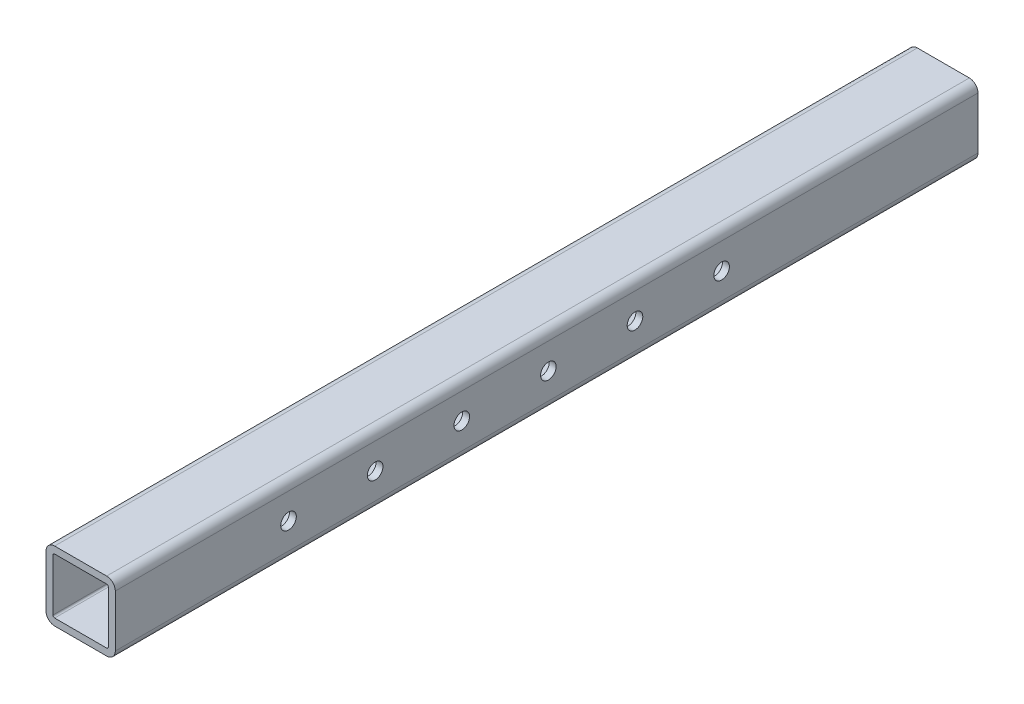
ISO-10303-21;
HEADER;
FILE_DESCRIPTION(('STEP AP214'),'2;1');
FILE_NAME('part.step','',(''),(''),'','','');
FILE_SCHEMA(('AUTOMOTIVE_DESIGN { 1 0 10303 214 1 1 1 1 }'));
ENDSEC;
DATA;
#1=APPLICATION_CONTEXT('core data for automotive mechanical design processes');
#2=APPLICATION_PROTOCOL_DEFINITION('international standard','automotive_design',2000,#1);
#3=PRODUCT_CONTEXT('',#1,'mechanical');
#4=PRODUCT('Part','Part','',(#3));
#5=PRODUCT_RELATED_PRODUCT_CATEGORY('part','',(#4));
#6=PRODUCT_DEFINITION_FORMATION('','',#4);
#7=PRODUCT_DEFINITION_CONTEXT('part definition',#1,'design');
#8=PRODUCT_DEFINITION('design','',#6,#7);
#9=PRODUCT_DEFINITION_SHAPE('','',#8);
#10=(LENGTH_UNIT() NAMED_UNIT(*) SI_UNIT(.MILLI.,.METRE.));
#11=(NAMED_UNIT(*) PLANE_ANGLE_UNIT() SI_UNIT($,.RADIAN.));
#12=(NAMED_UNIT(*) SI_UNIT($,.STERADIAN.) SOLID_ANGLE_UNIT());
#13=UNCERTAINTY_MEASURE_WITH_UNIT(LENGTH_MEASURE(1.E-05),#10,'distance_accuracy_value','');
#14=(GEOMETRIC_REPRESENTATION_CONTEXT(3) GLOBAL_UNCERTAINTY_ASSIGNED_CONTEXT((#13)) GLOBAL_UNIT_ASSIGNED_CONTEXT((#10,
#11,#12)) REPRESENTATION_CONTEXT('',''));
#15=CARTESIAN_POINT('',(0.,0.,0.));
#16=DIRECTION('',(0.,0.,1.));
#17=DIRECTION('',(1.,0.,0.));
#18=AXIS2_PLACEMENT_3D('',#15,#16,#17);
#19=CARTESIAN_POINT('',(35.,-5.,498.));
#20=DIRECTION('',(0.,0.,1.));
#21=DIRECTION('',(1.,0.,0.));
#22=AXIS2_PLACEMENT_3D('',#19,#20,#21);
#23=PLANE('',#22);
#24=CARTESIAN_POINT('',(35.,-5.,498.));
#25=DIRECTION('',(0.,0.,1.));
#26=DIRECTION('',(1.,0.,0.));
#27=AXIS2_PLACEMENT_3D('',#24,#25,#26);
#28=CIRCLE('',#27,5.);
#29=CARTESIAN_POINT('',(40.,-5.00000000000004,498.));
#30=VERTEX_POINT('',#29);
#31=CARTESIAN_POINT('',(35.,0.,498.));
#32=VERTEX_POINT('',#31);
#33=EDGE_CURVE('E229',#30,#32,#28,.T.);
#34=ORIENTED_EDGE('',*,*,#33,.T.);
#35=DIRECTION('',(-1.,0.,0.));
#36=VECTOR('',#35,1.);
#37=CARTESIAN_POINT('',(5.00000000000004,0.,498.));
#38=LINE('',#37,#36);
#39=CARTESIAN_POINT('',(5.00000000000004,0.,498.));
#40=VERTEX_POINT('',#39);
#41=EDGE_CURVE('E232',#32,#40,#38,.T.);
#42=ORIENTED_EDGE('',*,*,#41,.T.);
#43=CARTESIAN_POINT('',(5.,-5.,498.));
#44=DIRECTION('',(0.,0.,1.));
#45=DIRECTION('',(1.,0.,0.));
#46=AXIS2_PLACEMENT_3D('',#43,#44,#45);
#47=CIRCLE('',#46,5.);
#48=CARTESIAN_POINT('',(0.,-5.00000000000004,498.));
#49=VERTEX_POINT('',#48);
#50=EDGE_CURVE('E234',#40,#49,#47,.T.);
#51=ORIENTED_EDGE('',*,*,#50,.T.);
#52=DIRECTION('',(0.,-1.,0.));
#53=VECTOR('',#52,1.);
#54=CARTESIAN_POINT('',(0.,-5.00000000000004,498.));
#55=LINE('',#54,#53);
#56=CARTESIAN_POINT('',(0.,-35.,498.));
#57=VERTEX_POINT('',#56);
#58=EDGE_CURVE('E236',#49,#57,#55,.T.);
#59=ORIENTED_EDGE('',*,*,#58,.T.);
#60=CARTESIAN_POINT('',(5.,-35.,498.));
#61=DIRECTION('',(0.,0.,1.));
#62=DIRECTION('',(1.,0.,0.));
#63=AXIS2_PLACEMENT_3D('',#60,#61,#62);
#64=CIRCLE('',#63,5.);
#65=CARTESIAN_POINT('',(5.00000000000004,-40.,498.));
#66=VERTEX_POINT('',#65);
#67=EDGE_CURVE('E238',#57,#66,#64,.T.);
#68=ORIENTED_EDGE('',*,*,#67,.T.);
#69=DIRECTION('',(1.,0.,0.));
#70=VECTOR('',#69,1.);
#71=CARTESIAN_POINT('',(5.00000000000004,-40.,498.));
#72=LINE('',#71,#70);
#73=CARTESIAN_POINT('',(35.,-40.,498.));
#74=VERTEX_POINT('',#73);
#75=EDGE_CURVE('E240',#66,#74,#72,.T.);
#76=ORIENTED_EDGE('',*,*,#75,.T.);
#77=CARTESIAN_POINT('',(35.,-35.,498.));
#78=DIRECTION('',(0.,0.,1.));
#79=DIRECTION('',(1.,0.,0.));
#80=AXIS2_PLACEMENT_3D('',#77,#78,#79);
#81=CIRCLE('',#80,5.);
#82=CARTESIAN_POINT('',(40.,-35.,498.));
#83=VERTEX_POINT('',#82);
#84=EDGE_CURVE('E242',#74,#83,#81,.T.);
#85=ORIENTED_EDGE('',*,*,#84,.T.);
#86=DIRECTION('',(0.,1.,0.));
#87=VECTOR('',#86,1.);
#88=CARTESIAN_POINT('',(40.,-5.00000000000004,498.));
#89=LINE('',#88,#87);
#90=EDGE_CURVE('E244',#83,#30,#89,.T.);
#91=ORIENTED_EDGE('',*,*,#90,.T.);
#92=EDGE_LOOP('',(#34,#42,#51,#59,#68,#76,#85,#91));
#93=FACE_BOUND('',#92,.T.);
#94=DIRECTION('',(0.,-1.,0.));
#95=VECTOR('',#94,1.);
#96=CARTESIAN_POINT('',(4.,-5.00000000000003,498.));
#97=LINE('',#96,#95);
#98=CARTESIAN_POINT('',(4.,-5.00000000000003,498.));
#99=VERTEX_POINT('',#98);
#100=CARTESIAN_POINT('',(4.,-35.,498.));
#101=VERTEX_POINT('',#100);
#102=EDGE_CURVE('E187',#99,#101,#97,.T.);
#103=ORIENTED_EDGE('',*,*,#102,.F.);
#104=CARTESIAN_POINT('',(5.,-5.,498.));
#105=DIRECTION('',(0.,0.,1.));
#106=DIRECTION('',(1.,0.,0.));
#107=AXIS2_PLACEMENT_3D('',#104,#105,#106);
#108=CIRCLE('',#107,1.);
#109=CARTESIAN_POINT('',(5.00000000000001,-4.,498.));
#110=VERTEX_POINT('',#109);
#111=EDGE_CURVE('E159',#110,#99,#108,.T.);
#112=ORIENTED_EDGE('',*,*,#111,.F.);
#113=DIRECTION('',(-1.,0.,0.));
#114=VECTOR('',#113,1.);
#115=CARTESIAN_POINT('',(5.00000000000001,-4.,498.));
#116=LINE('',#115,#114);
#117=CARTESIAN_POINT('',(35.,-4.,498.));
#118=VERTEX_POINT('',#117);
#119=EDGE_CURVE('E199',#118,#110,#116,.T.);
#120=ORIENTED_EDGE('',*,*,#119,.F.);
#121=CARTESIAN_POINT('',(35.,-5.,498.));
#122=DIRECTION('',(0.,0.,1.));
#123=DIRECTION('',(1.,0.,0.));
#124=AXIS2_PLACEMENT_3D('',#121,#122,#123);
#125=CIRCLE('',#124,1.);
#126=CARTESIAN_POINT('',(36.,-5.00000000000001,498.));
#127=VERTEX_POINT('',#126);
#128=EDGE_CURVE('E197',#127,#118,#125,.T.);
#129=ORIENTED_EDGE('',*,*,#128,.F.);
#130=DIRECTION('',(0.,1.,0.));
#131=VECTOR('',#130,1.);
#132=CARTESIAN_POINT('',(36.,-5.00000000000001,498.));
#133=LINE('',#132,#131);
#134=CARTESIAN_POINT('',(36.,-35.,498.));
#135=VERTEX_POINT('',#134);
#136=EDGE_CURVE('E195',#135,#127,#133,.T.);
#137=ORIENTED_EDGE('',*,*,#136,.F.);
#138=CARTESIAN_POINT('',(35.,-35.,498.));
#139=DIRECTION('',(0.,0.,1.));
#140=DIRECTION('',(1.,0.,0.));
#141=AXIS2_PLACEMENT_3D('',#138,#139,#140);
#142=CIRCLE('',#141,1.);
#143=CARTESIAN_POINT('',(35.,-36.,498.));
#144=VERTEX_POINT('',#143);
#145=EDGE_CURVE('E193',#144,#135,#142,.T.);
#146=ORIENTED_EDGE('',*,*,#145,.F.);
#147=DIRECTION('',(1.,0.,0.));
#148=VECTOR('',#147,1.);
#149=CARTESIAN_POINT('',(5.00000000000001,-36.,498.));
#150=LINE('',#149,#148);
#151=CARTESIAN_POINT('',(5.00000000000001,-36.,498.));
#152=VERTEX_POINT('',#151);
#153=EDGE_CURVE('E191',#152,#144,#150,.T.);
#154=ORIENTED_EDGE('',*,*,#153,.F.);
#155=CARTESIAN_POINT('',(5.,-35.,498.));
#156=DIRECTION('',(0.,0.,1.));
#157=DIRECTION('',(1.,0.,0.));
#158=AXIS2_PLACEMENT_3D('',#155,#156,#157);
#159=CIRCLE('',#158,1.);
#160=EDGE_CURVE('E189',#101,#152,#159,.T.);
#161=ORIENTED_EDGE('',*,*,#160,.F.);
#162=EDGE_LOOP('',(#103,#112,#120,#129,#137,#146,#154,#161));
#163=FACE_BOUND('',#162,.T.);
#164=ADVANCED_FACE('F29',(#93,#163),#23,.T.);
#165=CARTESIAN_POINT('',(35.,-5.,0.));
#166=DIRECTION('',(0.,0.,1.));
#167=DIRECTION('',(1.,0.,0.));
#168=AXIS2_PLACEMENT_3D('',#165,#166,#167);
#169=PLANE('',#168);
#170=CARTESIAN_POINT('',(35.,-5.,0.));
#171=DIRECTION('',(0.,0.,1.));
#172=DIRECTION('',(1.,0.,0.));
#173=AXIS2_PLACEMENT_3D('',#170,#171,#172);
#174=CIRCLE('',#173,5.);
#175=CARTESIAN_POINT('',(40.,-5.00000000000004,0.));
#176=VERTEX_POINT('',#175);
#177=CARTESIAN_POINT('',(35.,0.,0.));
#178=VERTEX_POINT('',#177);
#179=EDGE_CURVE('E160',#176,#178,#174,.T.);
#180=ORIENTED_EDGE('',*,*,#179,.F.);
#181=DIRECTION('',(0.,1.,0.));
#182=VECTOR('',#181,1.);
#183=CARTESIAN_POINT('',(40.,-5.00000000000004,0.));
#184=LINE('',#183,#182);
#185=CARTESIAN_POINT('',(40.,-35.,0.));
#186=VERTEX_POINT('',#185);
#187=EDGE_CURVE('E227',#186,#176,#184,.T.);
#188=ORIENTED_EDGE('',*,*,#187,.F.);
#189=CARTESIAN_POINT('',(35.,-35.,0.));
#190=DIRECTION('',(0.,0.,1.));
#191=DIRECTION('',(1.,0.,0.));
#192=AXIS2_PLACEMENT_3D('',#189,#190,#191);
#193=CIRCLE('',#192,5.);
#194=CARTESIAN_POINT('',(35.,-40.,0.));
#195=VERTEX_POINT('',#194);
#196=EDGE_CURVE('E225',#195,#186,#193,.T.);
#197=ORIENTED_EDGE('',*,*,#196,.F.);
#198=DIRECTION('',(1.,0.,0.));
#199=VECTOR('',#198,1.);
#200=CARTESIAN_POINT('',(5.00000000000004,-40.,0.));
#201=LINE('',#200,#199);
#202=CARTESIAN_POINT('',(5.00000000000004,-40.,0.));
#203=VERTEX_POINT('',#202);
#204=EDGE_CURVE('E223',#203,#195,#201,.T.);
#205=ORIENTED_EDGE('',*,*,#204,.F.);
#206=CARTESIAN_POINT('',(5.,-35.,0.));
#207=DIRECTION('',(0.,0.,1.));
#208=DIRECTION('',(1.,0.,0.));
#209=AXIS2_PLACEMENT_3D('',#206,#207,#208);
#210=CIRCLE('',#209,5.);
#211=CARTESIAN_POINT('',(0.,-35.,0.));
#212=VERTEX_POINT('',#211);
#213=EDGE_CURVE('E221',#212,#203,#210,.T.);
#214=ORIENTED_EDGE('',*,*,#213,.F.);
#215=DIRECTION('',(0.,-1.,0.));
#216=VECTOR('',#215,1.);
#217=CARTESIAN_POINT('',(0.,-5.00000000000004,0.));
#218=LINE('',#217,#216);
#219=CARTESIAN_POINT('',(0.,-5.00000000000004,0.));
#220=VERTEX_POINT('',#219);
#221=EDGE_CURVE('E219',#220,#212,#218,.T.);
#222=ORIENTED_EDGE('',*,*,#221,.F.);
#223=CARTESIAN_POINT('',(5.,-5.,0.));
#224=DIRECTION('',(0.,0.,1.));
#225=DIRECTION('',(1.,0.,0.));
#226=AXIS2_PLACEMENT_3D('',#223,#224,#225);
#227=CIRCLE('',#226,5.);
#228=CARTESIAN_POINT('',(5.00000000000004,0.,0.));
#229=VERTEX_POINT('',#228);
#230=EDGE_CURVE('E217',#229,#220,#227,.T.);
#231=ORIENTED_EDGE('',*,*,#230,.F.);
#232=DIRECTION('',(-1.,0.,0.));
#233=VECTOR('',#232,1.);
#234=CARTESIAN_POINT('',(5.00000000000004,0.,0.));
#235=LINE('',#234,#233);
#236=EDGE_CURVE('E215',#178,#229,#235,.T.);
#237=ORIENTED_EDGE('',*,*,#236,.F.);
#238=EDGE_LOOP('',(#180,#188,#197,#205,#214,#222,#231,#237));
#239=FACE_BOUND('',#238,.T.);
#240=CARTESIAN_POINT('',(5.,-5.,0.));
#241=DIRECTION('',(0.,0.,1.));
#242=DIRECTION('',(1.,0.,0.));
#243=AXIS2_PLACEMENT_3D('',#240,#241,#242);
#244=CIRCLE('',#243,1.);
#245=CARTESIAN_POINT('',(5.00000000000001,-4.,0.));
#246=VERTEX_POINT('',#245);
#247=CARTESIAN_POINT('',(4.,-5.00000000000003,0.));
#248=VERTEX_POINT('',#247);
#249=EDGE_CURVE('E54',#246,#248,#244,.T.);
#250=ORIENTED_EDGE('',*,*,#249,.T.);
#251=DIRECTION('',(0.,-1.,0.));
#252=VECTOR('',#251,1.);
#253=CARTESIAN_POINT('',(4.,-5.00000000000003,0.));
#254=LINE('',#253,#252);
#255=CARTESIAN_POINT('',(4.,-35.,0.));
#256=VERTEX_POINT('',#255);
#257=EDGE_CURVE('E146',#248,#256,#254,.T.);
#258=ORIENTED_EDGE('',*,*,#257,.T.);
#259=CARTESIAN_POINT('',(5.,-35.,0.));
#260=DIRECTION('',(0.,0.,1.));
#261=DIRECTION('',(1.,0.,0.));
#262=AXIS2_PLACEMENT_3D('',#259,#260,#261);
#263=CIRCLE('',#262,1.);
#264=CARTESIAN_POINT('',(5.00000000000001,-36.,0.));
#265=VERTEX_POINT('',#264);
#266=EDGE_CURVE('E155',#256,#265,#263,.T.);
#267=ORIENTED_EDGE('',*,*,#266,.T.);
#268=DIRECTION('',(1.,0.,0.));
#269=VECTOR('',#268,1.);
#270=CARTESIAN_POINT('',(5.00000000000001,-36.,0.));
#271=LINE('',#270,#269);
#272=CARTESIAN_POINT('',(35.,-36.,0.));
#273=VERTEX_POINT('',#272);
#274=EDGE_CURVE('E174',#265,#273,#271,.T.);
#275=ORIENTED_EDGE('',*,*,#274,.T.);
#276=CARTESIAN_POINT('',(35.,-35.,0.));
#277=DIRECTION('',(0.,0.,1.));
#278=DIRECTION('',(1.,0.,0.));
#279=AXIS2_PLACEMENT_3D('',#276,#277,#278);
#280=CIRCLE('',#279,1.);
#281=CARTESIAN_POINT('',(36.,-35.,0.));
#282=VERTEX_POINT('',#281);
#283=EDGE_CURVE('E177',#273,#282,#280,.T.);
#284=ORIENTED_EDGE('',*,*,#283,.T.);
#285=DIRECTION('',(0.,1.,0.));
#286=VECTOR('',#285,1.);
#287=CARTESIAN_POINT('',(36.,-5.00000000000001,0.));
#288=LINE('',#287,#286);
#289=CARTESIAN_POINT('',(36.,-5.00000000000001,0.));
#290=VERTEX_POINT('',#289);
#291=EDGE_CURVE('E180',#282,#290,#288,.T.);
#292=ORIENTED_EDGE('',*,*,#291,.T.);
#293=CARTESIAN_POINT('',(35.,-5.,0.));
#294=DIRECTION('',(0.,0.,1.));
#295=DIRECTION('',(1.,0.,0.));
#296=AXIS2_PLACEMENT_3D('',#293,#294,#295);
#297=CIRCLE('',#296,1.);
#298=CARTESIAN_POINT('',(35.,-4.,0.));
#299=VERTEX_POINT('',#298);
#300=EDGE_CURVE('E183',#290,#299,#297,.T.);
#301=ORIENTED_EDGE('',*,*,#300,.T.);
#302=DIRECTION('',(-1.,0.,0.));
#303=VECTOR('',#302,1.);
#304=CARTESIAN_POINT('',(5.00000000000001,-4.,0.));
#305=LINE('',#304,#303);
#306=EDGE_CURVE('E165',#299,#246,#305,.T.);
#307=ORIENTED_EDGE('',*,*,#306,.T.);
#308=EDGE_LOOP('',(#250,#258,#267,#275,#284,#292,#301,#307));
#309=FACE_BOUND('',#308,.T.);
#310=ADVANCED_FACE('F163',(#239,#309),#169,.F.);
#311=CARTESIAN_POINT('',(35.,-5.,498.));
#312=DIRECTION('',(0.,0.,-1.));
#313=DIRECTION('',(-1.,0.,0.));
#314=AXIS2_PLACEMENT_3D('',#311,#312,#313);
#315=CYLINDRICAL_SURFACE('',#314,5.);
#316=ORIENTED_EDGE('',*,*,#179,.T.);
#317=DIRECTION('',(0.,0.,-1.));
#318=VECTOR('',#317,1.);
#319=CARTESIAN_POINT('',(35.,0.,498.));
#320=LINE('',#319,#318);
#321=EDGE_CURVE('E11',#32,#178,#320,.T.);
#322=ORIENTED_EDGE('',*,*,#321,.F.);
#323=ORIENTED_EDGE('',*,*,#33,.F.);
#324=DIRECTION('',(0.,0.,-1.));
#325=VECTOR('',#324,1.);
#326=CARTESIAN_POINT('',(40.,-5.00000000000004,498.));
#327=LINE('',#326,#325);
#328=EDGE_CURVE('E246',#30,#176,#327,.T.);
#329=ORIENTED_EDGE('',*,*,#328,.T.);
#330=EDGE_LOOP('',(#316,#322,#323,#329));
#331=FACE_BOUND('',#330,.T.);
#332=ADVANCED_FACE('F31',(#331),#315,.T.);
#333=CARTESIAN_POINT('',(5.00000000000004,0.,498.));
#334=DIRECTION('',(0.,-1.,0.));
#335=DIRECTION('',(0.,0.,-1.));
#336=AXIS2_PLACEMENT_3D('',#333,#334,#335);
#337=PLANE('',#336);
#338=ORIENTED_EDGE('',*,*,#236,.T.);
#339=DIRECTION('',(0.,0.,-1.));
#340=VECTOR('',#339,1.);
#341=CARTESIAN_POINT('',(5.00000000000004,0.,498.));
#342=LINE('',#341,#340);
#343=EDGE_CURVE('E38',#40,#229,#342,.T.);
#344=ORIENTED_EDGE('',*,*,#343,.F.);
#345=ORIENTED_EDGE('',*,*,#41,.F.);
#346=ORIENTED_EDGE('',*,*,#321,.T.);
#347=EDGE_LOOP('',(#338,#344,#345,#346));
#348=FACE_BOUND('',#347,.T.);
#349=ADVANCED_FACE('F377',(#348),#337,.F.);
#350=CARTESIAN_POINT('',(5.,-5.,498.));
#351=DIRECTION('',(0.,0.,-1.));
#352=DIRECTION('',(-1.,0.,0.));
#353=AXIS2_PLACEMENT_3D('',#350,#351,#352);
#354=CYLINDRICAL_SURFACE('',#353,5.);
#355=ORIENTED_EDGE('',*,*,#230,.T.);
#356=DIRECTION('',(0.,0.,-1.));
#357=VECTOR('',#356,1.);
#358=CARTESIAN_POINT('',(0.,-5.00000000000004,498.));
#359=LINE('',#358,#357);
#360=EDGE_CURVE('E261',#49,#220,#359,.T.);
#361=ORIENTED_EDGE('',*,*,#360,.F.);
#362=ORIENTED_EDGE('',*,*,#50,.F.);
#363=ORIENTED_EDGE('',*,*,#343,.T.);
#364=EDGE_LOOP('',(#355,#361,#362,#363));
#365=FACE_BOUND('',#364,.T.);
#366=ADVANCED_FACE('F374',(#365),#354,.T.);
#367=CARTESIAN_POINT('',(0.,-5.00000000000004,498.));
#368=DIRECTION('',(1.,0.,0.));
#369=DIRECTION('',(0.,1.,0.));
#370=AXIS2_PLACEMENT_3D('',#367,#368,#369);
#371=PLANE('',#370);
#372=CARTESIAN_POINT('',(0.,-20.,148.));
#373=DIRECTION('',(-1.,0.,0.));
#374=DIRECTION('',(0.,-1.,0.));
#375=AXIS2_PLACEMENT_3D('',#372,#373,#374);
#376=CIRCLE('',#375,4.49999999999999);
#377=CARTESIAN_POINT('',(0.,-24.5,148.));
#378=VERTEX_POINT('',#377);
#379=EDGE_CURVE('E628',#378,#378,#376,.T.);
#380=ORIENTED_EDGE('',*,*,#379,.F.);
#381=EDGE_LOOP('',(#380));
#382=FACE_BOUND('',#381,.T.);
#383=CARTESIAN_POINT('',(0.,-20.,198.));
#384=DIRECTION('',(-1.,0.,0.));
#385=DIRECTION('',(0.,-1.,0.));
#386=AXIS2_PLACEMENT_3D('',#383,#384,#385);
#387=CIRCLE('',#386,4.49999999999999);
#388=CARTESIAN_POINT('',(0.,-24.5,198.));
#389=VERTEX_POINT('',#388);
#390=EDGE_CURVE('E293',#389,#389,#387,.T.);
#391=ORIENTED_EDGE('',*,*,#390,.F.);
#392=EDGE_LOOP('',(#391));
#393=FACE_BOUND('',#392,.T.);
#394=CARTESIAN_POINT('',(0.,-20.,248.));
#395=DIRECTION('',(-1.,0.,0.));
#396=DIRECTION('',(0.,-1.,0.));
#397=AXIS2_PLACEMENT_3D('',#394,#395,#396);
#398=CIRCLE('',#397,4.50000000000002);
#399=CARTESIAN_POINT('',(0.,-24.5,248.));
#400=VERTEX_POINT('',#399);
#401=EDGE_CURVE('E290',#400,#400,#398,.T.);
#402=ORIENTED_EDGE('',*,*,#401,.F.);
#403=EDGE_LOOP('',(#402));
#404=FACE_BOUND('',#403,.T.);
#405=CARTESIAN_POINT('',(0.,-20.,298.));
#406=DIRECTION('',(-1.,0.,0.));
#407=DIRECTION('',(0.,-1.,0.));
#408=AXIS2_PLACEMENT_3D('',#405,#406,#407);
#409=CIRCLE('',#408,4.50000000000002);
#410=CARTESIAN_POINT('',(0.,-24.5,298.));
#411=VERTEX_POINT('',#410);
#412=EDGE_CURVE('E308',#411,#411,#409,.T.);
#413=ORIENTED_EDGE('',*,*,#412,.F.);
#414=EDGE_LOOP('',(#413));
#415=FACE_BOUND('',#414,.T.);
#416=CARTESIAN_POINT('',(0.,-20.,348.));
#417=DIRECTION('',(-1.,0.,0.));
#418=DIRECTION('',(0.,-1.,0.));
#419=AXIS2_PLACEMENT_3D('',#416,#417,#418);
#420=CIRCLE('',#419,4.50000000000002);
#421=CARTESIAN_POINT('',(0.,-24.5,348.));
#422=VERTEX_POINT('',#421);
#423=EDGE_CURVE('E315',#422,#422,#420,.T.);
#424=ORIENTED_EDGE('',*,*,#423,.F.);
#425=EDGE_LOOP('',(#424));
#426=FACE_BOUND('',#425,.T.);
#427=CARTESIAN_POINT('',(0.,-20.,398.));
#428=DIRECTION('',(-1.,0.,0.));
#429=DIRECTION('',(0.,-1.,0.));
#430=AXIS2_PLACEMENT_3D('',#427,#428,#429);
#431=CIRCLE('',#430,4.50000000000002);
#432=CARTESIAN_POINT('',(0.,-24.5,398.));
#433=VERTEX_POINT('',#432);
#434=EDGE_CURVE('E322',#433,#433,#431,.T.);
#435=ORIENTED_EDGE('',*,*,#434,.F.);
#436=EDGE_LOOP('',(#435));
#437=FACE_BOUND('',#436,.T.);
#438=ORIENTED_EDGE('',*,*,#221,.T.);
#439=DIRECTION('',(0.,0.,-1.));
#440=VECTOR('',#439,1.);
#441=CARTESIAN_POINT('',(0.,-35.,498.));
#442=LINE('',#441,#440);
#443=EDGE_CURVE('E258',#57,#212,#442,.T.);
#444=ORIENTED_EDGE('',*,*,#443,.F.);
#445=ORIENTED_EDGE('',*,*,#58,.F.);
#446=ORIENTED_EDGE('',*,*,#360,.T.);
#447=EDGE_LOOP('',(#438,#444,#445,#446));
#448=FACE_BOUND('',#447,.T.);
#449=ADVANCED_FACE('F370',(#382,#393,#404,#415,#426,#437,#448),#371,.F.);
#450=CARTESIAN_POINT('',(5.,-35.,498.));
#451=DIRECTION('',(0.,0.,-1.));
#452=DIRECTION('',(-1.,0.,0.));
#453=AXIS2_PLACEMENT_3D('',#450,#451,#452);
#454=CYLINDRICAL_SURFACE('',#453,5.);
#455=ORIENTED_EDGE('',*,*,#213,.T.);
#456=DIRECTION('',(0.,0.,-1.));
#457=VECTOR('',#456,1.);
#458=CARTESIAN_POINT('',(5.00000000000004,-40.,498.));
#459=LINE('',#458,#457);
#460=EDGE_CURVE('E255',#66,#203,#459,.T.);
#461=ORIENTED_EDGE('',*,*,#460,.F.);
#462=ORIENTED_EDGE('',*,*,#67,.F.);
#463=ORIENTED_EDGE('',*,*,#443,.T.);
#464=EDGE_LOOP('',(#455,#461,#462,#463));
#465=FACE_BOUND('',#464,.T.);
#466=ADVANCED_FACE('F366',(#465),#454,.T.);
#467=CARTESIAN_POINT('',(5.00000000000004,-40.,498.));
#468=DIRECTION('',(0.,1.,0.));
#469=DIRECTION('',(0.,0.,1.));
#470=AXIS2_PLACEMENT_3D('',#467,#468,#469);
#471=PLANE('',#470);
#472=ORIENTED_EDGE('',*,*,#204,.T.);
#473=DIRECTION('',(0.,0.,-1.));
#474=VECTOR('',#473,1.);
#475=CARTESIAN_POINT('',(35.,-40.,498.));
#476=LINE('',#475,#474);
#477=EDGE_CURVE('E252',#74,#195,#476,.T.);
#478=ORIENTED_EDGE('',*,*,#477,.F.);
#479=ORIENTED_EDGE('',*,*,#75,.F.);
#480=ORIENTED_EDGE('',*,*,#460,.T.);
#481=EDGE_LOOP('',(#472,#478,#479,#480));
#482=FACE_BOUND('',#481,.T.);
#483=ADVANCED_FACE('F362',(#482),#471,.F.);
#484=CARTESIAN_POINT('',(35.,-35.,498.));
#485=DIRECTION('',(0.,0.,-1.));
#486=DIRECTION('',(-1.,0.,0.));
#487=AXIS2_PLACEMENT_3D('',#484,#485,#486);
#488=CYLINDRICAL_SURFACE('',#487,5.);
#489=ORIENTED_EDGE('',*,*,#196,.T.);
#490=DIRECTION('',(0.,0.,-1.));
#491=VECTOR('',#490,1.);
#492=CARTESIAN_POINT('',(40.,-35.,498.));
#493=LINE('',#492,#491);
#494=EDGE_CURVE('E249',#83,#186,#493,.T.);
#495=ORIENTED_EDGE('',*,*,#494,.F.);
#496=ORIENTED_EDGE('',*,*,#84,.F.);
#497=ORIENTED_EDGE('',*,*,#477,.T.);
#498=EDGE_LOOP('',(#489,#495,#496,#497));
#499=FACE_BOUND('',#498,.T.);
#500=ADVANCED_FACE('F358',(#499),#488,.T.);
#501=CARTESIAN_POINT('',(40.,-5.00000000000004,498.));
#502=DIRECTION('',(-1.,0.,0.));
#503=DIRECTION('',(0.,-1.,0.));
#504=AXIS2_PLACEMENT_3D('',#501,#502,#503);
#505=PLANE('',#504);
#506=CARTESIAN_POINT('',(40.,-20.,148.));
#507=DIRECTION('',(-1.,0.,0.));
#508=DIRECTION('',(0.,-1.,0.));
#509=AXIS2_PLACEMENT_3D('',#506,#507,#508);
#510=CIRCLE('',#509,4.49999999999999);
#511=CARTESIAN_POINT('',(40.,-24.5,148.));
#512=VERTEX_POINT('',#511);
#513=EDGE_CURVE('E629',#512,#512,#510,.T.);
#514=ORIENTED_EDGE('',*,*,#513,.T.);
#515=EDGE_LOOP('',(#514));
#516=FACE_BOUND('',#515,.T.);
#517=CARTESIAN_POINT('',(40.,-20.,198.));
#518=DIRECTION('',(-1.,0.,0.));
#519=DIRECTION('',(0.,-1.,0.));
#520=AXIS2_PLACEMENT_3D('',#517,#518,#519);
#521=CIRCLE('',#520,4.49999999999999);
#522=CARTESIAN_POINT('',(40.,-24.5,198.));
#523=VERTEX_POINT('',#522);
#524=EDGE_CURVE('E286',#523,#523,#521,.T.);
#525=ORIENTED_EDGE('',*,*,#524,.T.);
#526=EDGE_LOOP('',(#525));
#527=FACE_BOUND('',#526,.T.);
#528=CARTESIAN_POINT('',(40.,-20.,248.));
#529=DIRECTION('',(-1.,0.,0.));
#530=DIRECTION('',(0.,-1.,0.));
#531=AXIS2_PLACEMENT_3D('',#528,#529,#530);
#532=CIRCLE('',#531,4.50000000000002);
#533=CARTESIAN_POINT('',(40.,-24.5,248.));
#534=VERTEX_POINT('',#533);
#535=EDGE_CURVE('E282',#534,#534,#532,.T.);
#536=ORIENTED_EDGE('',*,*,#535,.T.);
#537=EDGE_LOOP('',(#536));
#538=FACE_BOUND('',#537,.T.);
#539=CARTESIAN_POINT('',(40.,-20.,298.));
#540=DIRECTION('',(-1.,0.,0.));
#541=DIRECTION('',(0.,-1.,0.));
#542=AXIS2_PLACEMENT_3D('',#539,#540,#541);
#543=CIRCLE('',#542,4.50000000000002);
#544=CARTESIAN_POINT('',(40.,-24.5,298.));
#545=VERTEX_POINT('',#544);
#546=EDGE_CURVE('E278',#545,#545,#543,.T.);
#547=ORIENTED_EDGE('',*,*,#546,.T.);
#548=EDGE_LOOP('',(#547));
#549=FACE_BOUND('',#548,.T.);
#550=CARTESIAN_POINT('',(40.,-20.,348.));
#551=DIRECTION('',(-1.,0.,0.));
#552=DIRECTION('',(0.,-1.,0.));
#553=AXIS2_PLACEMENT_3D('',#550,#551,#552);
#554=CIRCLE('',#553,4.50000000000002);
#555=CARTESIAN_POINT('',(40.,-24.5,348.));
#556=VERTEX_POINT('',#555);
#557=EDGE_CURVE('E273',#556,#556,#554,.T.);
#558=ORIENTED_EDGE('',*,*,#557,.T.);
#559=EDGE_LOOP('',(#558));
#560=FACE_BOUND('',#559,.T.);
#561=CARTESIAN_POINT('',(40.,-20.,398.));
#562=DIRECTION('',(-1.,0.,0.));
#563=DIRECTION('',(0.,-1.,0.));
#564=AXIS2_PLACEMENT_3D('',#561,#562,#563);
#565=CIRCLE('',#564,4.50000000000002);
#566=CARTESIAN_POINT('',(40.,-24.5,398.));
#567=VERTEX_POINT('',#566);
#568=EDGE_CURVE('E268',#567,#567,#565,.T.);
#569=ORIENTED_EDGE('',*,*,#568,.T.);
#570=EDGE_LOOP('',(#569));
#571=FACE_BOUND('',#570,.T.);
#572=ORIENTED_EDGE('',*,*,#187,.T.);
#573=ORIENTED_EDGE('',*,*,#328,.F.);
#574=ORIENTED_EDGE('',*,*,#90,.F.);
#575=ORIENTED_EDGE('',*,*,#494,.T.);
#576=EDGE_LOOP('',(#572,#573,#574,#575));
#577=FACE_BOUND('',#576,.T.);
#578=ADVANCED_FACE('F327',(#516,#527,#538,#549,#560,#571,#577),#505,.F.);
#579=CARTESIAN_POINT('',(5.,-5.,498.));
#580=DIRECTION('',(0.,0.,-1.));
#581=DIRECTION('',(-1.,0.,0.));
#582=AXIS2_PLACEMENT_3D('',#579,#580,#581);
#583=CYLINDRICAL_SURFACE('',#582,1.);
#584=ORIENTED_EDGE('',*,*,#249,.F.);
#585=DIRECTION('',(0.,0.,-1.));
#586=VECTOR('',#585,1.);
#587=CARTESIAN_POINT('',(5.00000000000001,-4.,498.));
#588=LINE('',#587,#586);
#589=EDGE_CURVE('E201',#110,#246,#588,.T.);
#590=ORIENTED_EDGE('',*,*,#589,.F.);
#591=ORIENTED_EDGE('',*,*,#111,.T.);
#592=DIRECTION('',(0.,0.,-1.));
#593=VECTOR('',#592,1.);
#594=CARTESIAN_POINT('',(4.,-5.00000000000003,498.));
#595=LINE('',#594,#593);
#596=EDGE_CURVE('E148',#99,#248,#595,.T.);
#597=ORIENTED_EDGE('',*,*,#596,.T.);
#598=EDGE_LOOP('',(#584,#590,#591,#597));
#599=FACE_BOUND('',#598,.T.);
#600=ADVANCED_FACE('F157',(#599),#583,.F.);
#601=CARTESIAN_POINT('',(4.,-5.00000000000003,498.));
#602=DIRECTION('',(1.,0.,0.));
#603=DIRECTION('',(0.,1.,0.));
#604=AXIS2_PLACEMENT_3D('',#601,#602,#603);
#605=PLANE('',#604);
#606=CARTESIAN_POINT('',(4.,-20.,148.));
#607=DIRECTION('',(1.,0.,0.));
#608=DIRECTION('',(0.,1.,0.));
#609=AXIS2_PLACEMENT_3D('',#606,#607,#608);
#610=CIRCLE('',#609,4.49999999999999);
#611=CARTESIAN_POINT('',(4.,-15.5,148.));
#612=VERTEX_POINT('',#611);
#613=EDGE_CURVE('E298',#612,#612,#610,.T.);
#614=ORIENTED_EDGE('',*,*,#613,.F.);
#615=EDGE_LOOP('',(#614));
#616=FACE_BOUND('',#615,.T.);
#617=CARTESIAN_POINT('',(4.,-20.,198.));
#618=DIRECTION('',(1.,0.,0.));
#619=DIRECTION('',(0.,1.,0.));
#620=AXIS2_PLACEMENT_3D('',#617,#618,#619);
#621=CIRCLE('',#620,4.49999999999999);
#622=CARTESIAN_POINT('',(4.,-15.5,198.));
#623=VERTEX_POINT('',#622);
#624=EDGE_CURVE('E285',#623,#623,#621,.T.);
#625=ORIENTED_EDGE('',*,*,#624,.F.);
#626=EDGE_LOOP('',(#625));
#627=FACE_BOUND('',#626,.T.);
#628=CARTESIAN_POINT('',(4.,-20.,248.));
#629=DIRECTION('',(1.,0.,0.));
#630=DIRECTION('',(0.,1.,0.));
#631=AXIS2_PLACEMENT_3D('',#628,#629,#630);
#632=CIRCLE('',#631,4.50000000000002);
#633=CARTESIAN_POINT('',(4.,-15.5,248.));
#634=VERTEX_POINT('',#633);
#635=EDGE_CURVE('E281',#634,#634,#632,.T.);
#636=ORIENTED_EDGE('',*,*,#635,.F.);
#637=EDGE_LOOP('',(#636));
#638=FACE_BOUND('',#637,.T.);
#639=CARTESIAN_POINT('',(4.,-20.,298.));
#640=DIRECTION('',(1.,0.,0.));
#641=DIRECTION('',(0.,1.,0.));
#642=AXIS2_PLACEMENT_3D('',#639,#640,#641);
#643=CIRCLE('',#642,4.50000000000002);
#644=CARTESIAN_POINT('',(4.,-15.5,298.));
#645=VERTEX_POINT('',#644);
#646=EDGE_CURVE('E277',#645,#645,#643,.T.);
#647=ORIENTED_EDGE('',*,*,#646,.F.);
#648=EDGE_LOOP('',(#647));
#649=FACE_BOUND('',#648,.T.);
#650=CARTESIAN_POINT('',(4.,-20.,348.));
#651=DIRECTION('',(1.,0.,0.));
#652=DIRECTION('',(0.,1.,0.));
#653=AXIS2_PLACEMENT_3D('',#650,#651,#652);
#654=CIRCLE('',#653,4.50000000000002);
#655=CARTESIAN_POINT('',(4.,-15.5,348.));
#656=VERTEX_POINT('',#655);
#657=EDGE_CURVE('E272',#656,#656,#654,.T.);
#658=ORIENTED_EDGE('',*,*,#657,.F.);
#659=EDGE_LOOP('',(#658));
#660=FACE_BOUND('',#659,.T.);
#661=CARTESIAN_POINT('',(4.,-20.,398.));
#662=DIRECTION('',(1.,0.,0.));
#663=DIRECTION('',(0.,1.,0.));
#664=AXIS2_PLACEMENT_3D('',#661,#662,#663);
#665=CIRCLE('',#664,4.50000000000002);
#666=CARTESIAN_POINT('',(4.,-15.5,398.));
#667=VERTEX_POINT('',#666);
#668=EDGE_CURVE('E166',#667,#667,#665,.T.);
#669=ORIENTED_EDGE('',*,*,#668,.F.);
#670=EDGE_LOOP('',(#669));
#671=FACE_BOUND('',#670,.T.);
#672=ORIENTED_EDGE('',*,*,#257,.F.);
#673=ORIENTED_EDGE('',*,*,#596,.F.);
#674=ORIENTED_EDGE('',*,*,#102,.T.);
#675=DIRECTION('',(0.,0.,-1.));
#676=VECTOR('',#675,1.);
#677=CARTESIAN_POINT('',(4.,-35.,498.));
#678=LINE('',#677,#676);
#679=EDGE_CURVE('E151',#101,#256,#678,.T.);
#680=ORIENTED_EDGE('',*,*,#679,.T.);
#681=EDGE_LOOP('',(#672,#673,#674,#680));
#682=FACE_BOUND('',#681,.T.);
#683=ADVANCED_FACE('F147',(#616,#627,#638,#649,#660,#671,#682),#605,.T.);
#684=CARTESIAN_POINT('',(5.,-35.,498.));
#685=DIRECTION('',(0.,0.,-1.));
#686=DIRECTION('',(-1.,0.,0.));
#687=AXIS2_PLACEMENT_3D('',#684,#685,#686);
#688=CYLINDRICAL_SURFACE('',#687,1.);
#689=ORIENTED_EDGE('',*,*,#266,.F.);
#690=ORIENTED_EDGE('',*,*,#679,.F.);
#691=ORIENTED_EDGE('',*,*,#160,.T.);
#692=DIRECTION('',(0.,0.,-1.));
#693=VECTOR('',#692,1.);
#694=CARTESIAN_POINT('',(5.00000000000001,-36.,498.));
#695=LINE('',#694,#693);
#696=EDGE_CURVE('E210',#152,#265,#695,.T.);
#697=ORIENTED_EDGE('',*,*,#696,.T.);
#698=EDGE_LOOP('',(#689,#690,#691,#697));
#699=FACE_BOUND('',#698,.T.);
#700=ADVANCED_FACE('F470',(#699),#688,.F.);
#701=CARTESIAN_POINT('',(5.00000000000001,-36.,498.));
#702=DIRECTION('',(0.,1.,0.));
#703=DIRECTION('',(0.,0.,1.));
#704=AXIS2_PLACEMENT_3D('',#701,#702,#703);
#705=PLANE('',#704);
#706=ORIENTED_EDGE('',*,*,#274,.F.);
#707=ORIENTED_EDGE('',*,*,#696,.F.);
#708=ORIENTED_EDGE('',*,*,#153,.T.);
#709=DIRECTION('',(0.,0.,-1.));
#710=VECTOR('',#709,1.);
#711=CARTESIAN_POINT('',(35.,-36.,498.));
#712=LINE('',#711,#710);
#713=EDGE_CURVE('E208',#144,#273,#712,.T.);
#714=ORIENTED_EDGE('',*,*,#713,.T.);
#715=EDGE_LOOP('',(#706,#707,#708,#714));
#716=FACE_BOUND('',#715,.T.);
#717=ADVANCED_FACE('F479',(#716),#705,.T.);
#718=CARTESIAN_POINT('',(35.,-35.,498.));
#719=DIRECTION('',(0.,0.,-1.));
#720=DIRECTION('',(-1.,0.,0.));
#721=AXIS2_PLACEMENT_3D('',#718,#719,#720);
#722=CYLINDRICAL_SURFACE('',#721,1.);
#723=ORIENTED_EDGE('',*,*,#283,.F.);
#724=ORIENTED_EDGE('',*,*,#713,.F.);
#725=ORIENTED_EDGE('',*,*,#145,.T.);
#726=DIRECTION('',(0.,0.,-1.));
#727=VECTOR('',#726,1.);
#728=CARTESIAN_POINT('',(36.,-35.,498.));
#729=LINE('',#728,#727);
#730=EDGE_CURVE('E206',#135,#282,#729,.T.);
#731=ORIENTED_EDGE('',*,*,#730,.T.);
#732=EDGE_LOOP('',(#723,#724,#725,#731));
#733=FACE_BOUND('',#732,.T.);
#734=ADVANCED_FACE('F488',(#733),#722,.F.);
#735=CARTESIAN_POINT('',(36.,-5.00000000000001,498.));
#736=DIRECTION('',(-1.,0.,0.));
#737=DIRECTION('',(0.,-1.,0.));
#738=AXIS2_PLACEMENT_3D('',#735,#736,#737);
#739=PLANE('',#738);
#740=CARTESIAN_POINT('',(36.,-20.,148.));
#741=DIRECTION('',(-1.,0.,0.));
#742=DIRECTION('',(0.,-1.,0.));
#743=AXIS2_PLACEMENT_3D('',#740,#741,#742);
#744=CIRCLE('',#743,4.49999999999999);
#745=CARTESIAN_POINT('',(36.,-24.5,148.));
#746=VERTEX_POINT('',#745);
#747=EDGE_CURVE('E33',#746,#746,#744,.T.);
#748=ORIENTED_EDGE('',*,*,#747,.F.);
#749=EDGE_LOOP('',(#748));
#750=FACE_BOUND('',#749,.T.);
#751=CARTESIAN_POINT('',(36.,-20.,198.));
#752=DIRECTION('',(-1.,0.,0.));
#753=DIRECTION('',(0.,-1.,0.));
#754=AXIS2_PLACEMENT_3D('',#751,#752,#753);
#755=CIRCLE('',#754,4.49999999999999);
#756=CARTESIAN_POINT('',(36.,-24.5,198.));
#757=VERTEX_POINT('',#756);
#758=EDGE_CURVE('E283',#757,#757,#755,.T.);
#759=ORIENTED_EDGE('',*,*,#758,.F.);
#760=EDGE_LOOP('',(#759));
#761=FACE_BOUND('',#760,.T.);
#762=CARTESIAN_POINT('',(36.,-20.,248.));
#763=DIRECTION('',(-1.,0.,0.));
#764=DIRECTION('',(0.,-1.,0.));
#765=AXIS2_PLACEMENT_3D('',#762,#763,#764);
#766=CIRCLE('',#765,4.50000000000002);
#767=CARTESIAN_POINT('',(36.,-24.5,248.));
#768=VERTEX_POINT('',#767);
#769=EDGE_CURVE('E279',#768,#768,#766,.T.);
#770=ORIENTED_EDGE('',*,*,#769,.F.);
#771=EDGE_LOOP('',(#770));
#772=FACE_BOUND('',#771,.T.);
#773=CARTESIAN_POINT('',(36.,-20.,298.));
#774=DIRECTION('',(-1.,0.,0.));
#775=DIRECTION('',(0.,-1.,0.));
#776=AXIS2_PLACEMENT_3D('',#773,#774,#775);
#777=CIRCLE('',#776,4.50000000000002);
#778=CARTESIAN_POINT('',(36.,-24.5,298.));
#779=VERTEX_POINT('',#778);
#780=EDGE_CURVE('E274',#779,#779,#777,.T.);
#781=ORIENTED_EDGE('',*,*,#780,.F.);
#782=EDGE_LOOP('',(#781));
#783=FACE_BOUND('',#782,.T.);
#784=CARTESIAN_POINT('',(36.,-20.,348.));
#785=DIRECTION('',(-1.,0.,0.));
#786=DIRECTION('',(0.,-1.,0.));
#787=AXIS2_PLACEMENT_3D('',#784,#785,#786);
#788=CIRCLE('',#787,4.50000000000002);
#789=CARTESIAN_POINT('',(36.,-24.5,348.));
#790=VERTEX_POINT('',#789);
#791=EDGE_CURVE('E269',#790,#790,#788,.T.);
#792=ORIENTED_EDGE('',*,*,#791,.F.);
#793=EDGE_LOOP('',(#792));
#794=FACE_BOUND('',#793,.T.);
#795=CARTESIAN_POINT('',(36.,-20.,398.));
#796=DIRECTION('',(-1.,0.,0.));
#797=DIRECTION('',(0.,-1.,0.));
#798=AXIS2_PLACEMENT_3D('',#795,#796,#797);
#799=CIRCLE('',#798,4.50000000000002);
#800=CARTESIAN_POINT('',(36.,-24.5,398.));
#801=VERTEX_POINT('',#800);
#802=EDGE_CURVE('E169',#801,#801,#799,.T.);
#803=ORIENTED_EDGE('',*,*,#802,.F.);
#804=EDGE_LOOP('',(#803));
#805=FACE_BOUND('',#804,.T.);
#806=ORIENTED_EDGE('',*,*,#291,.F.);
#807=ORIENTED_EDGE('',*,*,#730,.F.);
#808=ORIENTED_EDGE('',*,*,#136,.T.);
#809=DIRECTION('',(0.,0.,-1.));
#810=VECTOR('',#809,1.);
#811=CARTESIAN_POINT('',(36.,-5.00000000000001,498.));
#812=LINE('',#811,#810);
#813=EDGE_CURVE('E204',#127,#290,#812,.T.);
#814=ORIENTED_EDGE('',*,*,#813,.T.);
#815=EDGE_LOOP('',(#806,#807,#808,#814));
#816=FACE_BOUND('',#815,.T.);
#817=ADVANCED_FACE('F497',(#750,#761,#772,#783,#794,#805,#816),#739,.T.);
#818=CARTESIAN_POINT('',(35.,-5.,498.));
#819=DIRECTION('',(0.,0.,-1.));
#820=DIRECTION('',(-1.,0.,0.));
#821=AXIS2_PLACEMENT_3D('',#818,#819,#820);
#822=CYLINDRICAL_SURFACE('',#821,1.);
#823=ORIENTED_EDGE('',*,*,#300,.F.);
#824=ORIENTED_EDGE('',*,*,#813,.F.);
#825=ORIENTED_EDGE('',*,*,#128,.T.);
#826=DIRECTION('',(0.,0.,-1.));
#827=VECTOR('',#826,1.);
#828=CARTESIAN_POINT('',(35.,-4.,498.));
#829=LINE('',#828,#827);
#830=EDGE_CURVE('E46',#118,#299,#829,.T.);
#831=ORIENTED_EDGE('',*,*,#830,.T.);
#832=EDGE_LOOP('',(#823,#824,#825,#831));
#833=FACE_BOUND('',#832,.T.);
#834=ADVANCED_FACE('F342',(#833),#822,.F.);
#835=CARTESIAN_POINT('',(5.00000000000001,-4.,498.));
#836=DIRECTION('',(0.,-1.,0.));
#837=DIRECTION('',(0.,0.,-1.));
#838=AXIS2_PLACEMENT_3D('',#835,#836,#837);
#839=PLANE('',#838);
#840=ORIENTED_EDGE('',*,*,#306,.F.);
#841=ORIENTED_EDGE('',*,*,#830,.F.);
#842=ORIENTED_EDGE('',*,*,#119,.T.);
#843=ORIENTED_EDGE('',*,*,#589,.T.);
#844=EDGE_LOOP('',(#840,#841,#842,#843));
#845=FACE_BOUND('',#844,.T.);
#846=ADVANCED_FACE('F333',(#845),#839,.T.);
#847=CARTESIAN_POINT('',(40.,-20.,398.));
#848=DIRECTION('',(-1.,0.,0.));
#849=DIRECTION('',(0.,-1.,0.));
#850=AXIS2_PLACEMENT_3D('',#847,#848,#849);
#851=CYLINDRICAL_SURFACE('',#850,4.50000000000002);
#852=ORIENTED_EDGE('',*,*,#802,.T.);
#853=EDGE_LOOP('',(#852));
#854=FACE_BOUND('',#853,.T.);
#855=ORIENTED_EDGE('',*,*,#568,.F.);
#856=EDGE_LOOP('',(#855));
#857=FACE_BOUND('',#856,.T.);
#858=ADVANCED_FACE('F330',(#854,#857),#851,.F.);
#859=ORIENTED_EDGE('',*,*,#668,.T.);
#860=EDGE_LOOP('',(#859));
#861=FACE_BOUND('',#860,.T.);
#862=ORIENTED_EDGE('',*,*,#434,.T.);
#863=EDGE_LOOP('',(#862));
#864=FACE_BOUND('',#863,.T.);
#865=ADVANCED_FACE('F332',(#861,#864),#851,.F.);
#866=CARTESIAN_POINT('',(40.,-20.,348.));
#867=DIRECTION('',(-1.,0.,0.));
#868=DIRECTION('',(0.,-1.,0.));
#869=AXIS2_PLACEMENT_3D('',#866,#867,#868);
#870=CYLINDRICAL_SURFACE('',#869,4.50000000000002);
#871=ORIENTED_EDGE('',*,*,#791,.T.);
#872=EDGE_LOOP('',(#871));
#873=FACE_BOUND('',#872,.T.);
#874=ORIENTED_EDGE('',*,*,#557,.F.);
#875=EDGE_LOOP('',(#874));
#876=FACE_BOUND('',#875,.T.);
#877=ADVANCED_FACE('F340',(#873,#876),#870,.F.);
#878=ORIENTED_EDGE('',*,*,#657,.T.);
#879=EDGE_LOOP('',(#878));
#880=FACE_BOUND('',#879,.T.);
#881=ORIENTED_EDGE('',*,*,#423,.T.);
#882=EDGE_LOOP('',(#881));
#883=FACE_BOUND('',#882,.T.);
#884=ADVANCED_FACE('F536',(#880,#883),#870,.F.);
#885=CARTESIAN_POINT('',(40.,-20.,298.));
#886=DIRECTION('',(-1.,0.,0.));
#887=DIRECTION('',(0.,-1.,0.));
#888=AXIS2_PLACEMENT_3D('',#885,#886,#887);
#889=CYLINDRICAL_SURFACE('',#888,4.50000000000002);
#890=ORIENTED_EDGE('',*,*,#780,.T.);
#891=EDGE_LOOP('',(#890));
#892=FACE_BOUND('',#891,.T.);
#893=ORIENTED_EDGE('',*,*,#546,.F.);
#894=EDGE_LOOP('',(#893));
#895=FACE_BOUND('',#894,.T.);
#896=ADVANCED_FACE('F544',(#892,#895),#889,.F.);
#897=ORIENTED_EDGE('',*,*,#646,.T.);
#898=EDGE_LOOP('',(#897));
#899=FACE_BOUND('',#898,.T.);
#900=ORIENTED_EDGE('',*,*,#412,.T.);
#901=EDGE_LOOP('',(#900));
#902=FACE_BOUND('',#901,.T.);
#903=ADVANCED_FACE('F552',(#899,#902),#889,.F.);
#904=CARTESIAN_POINT('',(40.,-20.,248.));
#905=DIRECTION('',(-1.,0.,0.));
#906=DIRECTION('',(0.,-1.,0.));
#907=AXIS2_PLACEMENT_3D('',#904,#905,#906);
#908=CYLINDRICAL_SURFACE('',#907,4.50000000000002);
#909=ORIENTED_EDGE('',*,*,#769,.T.);
#910=EDGE_LOOP('',(#909));
#911=FACE_BOUND('',#910,.T.);
#912=ORIENTED_EDGE('',*,*,#535,.F.);
#913=EDGE_LOOP('',(#912));
#914=FACE_BOUND('',#913,.T.);
#915=ADVANCED_FACE('F561',(#911,#914),#908,.F.);
#916=ORIENTED_EDGE('',*,*,#635,.T.);
#917=EDGE_LOOP('',(#916));
#918=FACE_BOUND('',#917,.T.);
#919=ORIENTED_EDGE('',*,*,#401,.T.);
#920=EDGE_LOOP('',(#919));
#921=FACE_BOUND('',#920,.T.);
#922=ADVANCED_FACE('F569',(#918,#921),#908,.F.);
#923=CARTESIAN_POINT('',(40.,-20.,198.));
#924=DIRECTION('',(-1.,0.,0.));
#925=DIRECTION('',(0.,-1.,0.));
#926=AXIS2_PLACEMENT_3D('',#923,#924,#925);
#927=CYLINDRICAL_SURFACE('',#926,4.49999999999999);
#928=ORIENTED_EDGE('',*,*,#758,.T.);
#929=EDGE_LOOP('',(#928));
#930=FACE_BOUND('',#929,.T.);
#931=ORIENTED_EDGE('',*,*,#524,.F.);
#932=EDGE_LOOP('',(#931));
#933=FACE_BOUND('',#932,.T.);
#934=ADVANCED_FACE('F578',(#930,#933),#927,.F.);
#935=ORIENTED_EDGE('',*,*,#624,.T.);
#936=EDGE_LOOP('',(#935));
#937=FACE_BOUND('',#936,.T.);
#938=ORIENTED_EDGE('',*,*,#390,.T.);
#939=EDGE_LOOP('',(#938));
#940=FACE_BOUND('',#939,.T.);
#941=ADVANCED_FACE('F586',(#937,#940),#927,.F.);
#942=CARTESIAN_POINT('',(40.,-20.,148.));
#943=DIRECTION('',(-1.,0.,0.));
#944=DIRECTION('',(0.,-1.,0.));
#945=AXIS2_PLACEMENT_3D('',#942,#943,#944);
#946=CYLINDRICAL_SURFACE('',#945,4.49999999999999);
#947=ORIENTED_EDGE('',*,*,#747,.T.);
#948=EDGE_LOOP('',(#947));
#949=FACE_BOUND('',#948,.T.);
#950=ORIENTED_EDGE('',*,*,#513,.F.);
#951=EDGE_LOOP('',(#950));
#952=FACE_BOUND('',#951,.T.);
#953=ADVANCED_FACE('F594',(#949,#952),#946,.F.);
#954=ORIENTED_EDGE('',*,*,#613,.T.);
#955=EDGE_LOOP('',(#954));
#956=FACE_BOUND('',#955,.T.);
#957=ORIENTED_EDGE('',*,*,#379,.T.);
#958=EDGE_LOOP('',(#957));
#959=FACE_BOUND('',#958,.T.);
#960=ADVANCED_FACE('F602',(#956,#959),#946,.F.);
#961=CLOSED_SHELL('',(#164,#310,#332,#349,#366,#449,#466,#483,#500,#578,#600,#683,#700,#717,
#734,#817,#834,#846,#858,#865,#877,#884,#896,#903,#915,#922,#934,#941,#953,#960));
#962=MANIFOLD_SOLID_BREP('B2',#961);
#963=ADVANCED_BREP_SHAPE_REPRESENTATION('',(#18,#962),#14);
#964=SHAPE_DEFINITION_REPRESENTATION(#9,#963);
ENDSEC;
END-ISO-10303-21;
